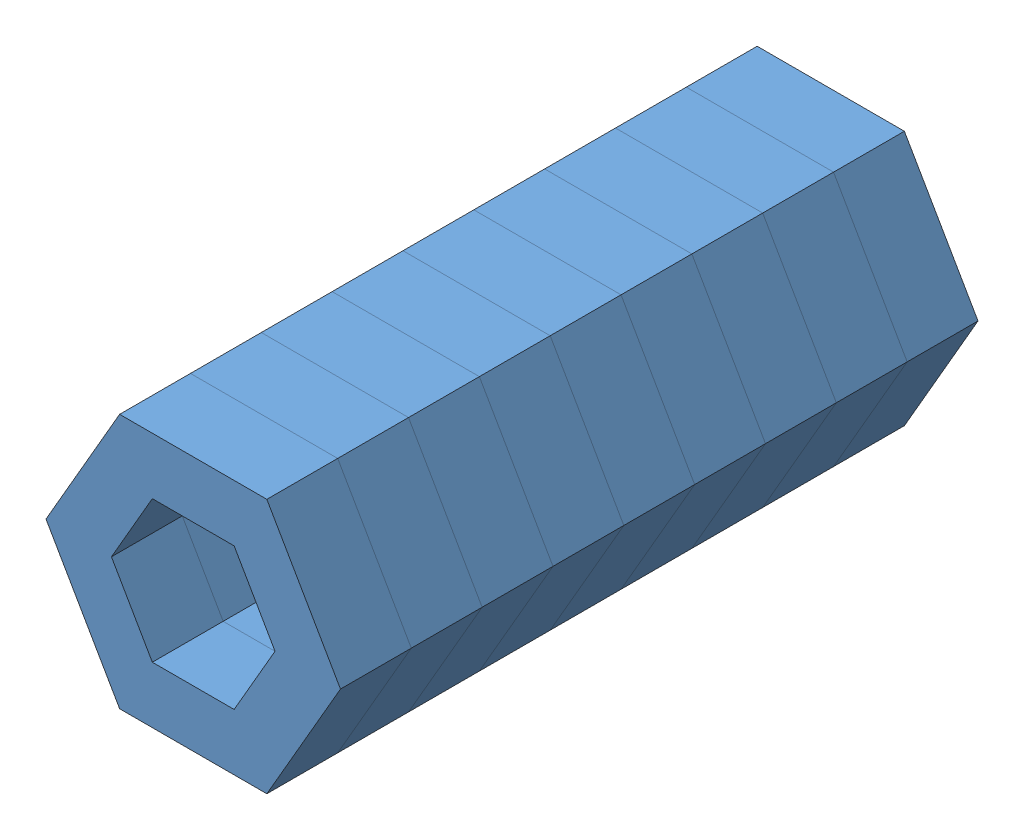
SolidWorks assembly Spacer-stack-9.SLDASM, configuration Default (file format 7000). Lengths in mm.
Overall size (13.2 11.43 28.57).
9 component instances, 1 part files, 16 mates.
Components (placement in the parent):
- Spacer-hex-1s4-1: Spacer-hex-1s4.SLDPRT [Default] at (7.8847 8.4687 7.4956) size (13.2 11.43 3.17)
- Spacer-hex-1s4-2: Spacer-hex-1s4.SLDPRT [Default] at (7.8847 8.4687 10.6706) size (13.2 11.43 3.17)
- Spacer-hex-1s4-3: Spacer-hex-1s4.SLDPRT [Default] at (7.8847 8.4687 13.8456) size (13.2 11.43 3.17)
- Spacer-hex-1s4-4: Spacer-hex-1s4.SLDPRT [Default] at (7.8847 8.4687 17.0206) size (13.2 11.43 3.17)
- Spacer-hex-1s4-5: Spacer-hex-1s4.SLDPRT [Default] at (7.8847 8.4687 20.1956) size (13.2 11.43 3.17)
- Spacer-hex-1s4-6: Spacer-hex-1s4.SLDPRT [Default] at (7.8847 8.4687 23.3706) size (13.2 11.43 3.17)
- Spacer-hex-1s4-7: Spacer-hex-1s4.SLDPRT [Default] at (7.8847 8.4687 26.5456) size (13.2 11.43 3.17)
- Spacer-hex-1s4-8: Spacer-hex-1s4.SLDPRT [Default] at (7.8847 8.4687 29.7206) size (13.2 11.43 3.17)
- Spacer-hex-1s4-9: Spacer-hex-1s4.SLDPRT [Default] at (7.8847 8.4687 32.8956) size (13.2 11.43 3.17)
Mates (geometry in assembly coordinates):
- Coincident3: coincident aligned: line of Spacer-hex-1s4-1 through (9.7178 11.6437 10.6706) axis (-1 0 0); line of Spacer-hex-1s4-2 through (9.7178 11.6437 10.6706) axis (-1 0 0)
- Coincident4: coincident aligned: line of Spacer-hex-1s4-1 through (11.5509 8.4687 10.6706) axis (-0.5 0.866025 0); line of Spacer-hex-1s4-2 through (11.5509 8.4687 10.6706) axis (-0.5 0.866025 0)
- Coincident5: coincident aligned: line of Spacer-hex-1s4-2 through (9.7178 11.6437 13.8456) axis (-1 0 0); line of Spacer-hex-1s4-3 through (9.7178 11.6437 13.8456) axis (-1 0 0)
- Coincident6: coincident aligned: line of Spacer-hex-1s4-2 through (11.5509 8.4687 13.8456) axis (-0.5 0.866025 0); line of Spacer-hex-1s4-3 through (11.5509 8.4687 13.8456) axis (-0.5 0.866025 0)
- Coincident9: coincident aligned: line of Spacer-hex-1s4-3 through (11.5509 8.4687 17.0206) axis (-0.5 0.866025 0); line of Spacer-hex-1s4-4 through (11.5509 8.4687 17.0206) axis (-0.5 0.866025 0)
- Coincident10: coincident aligned: line of Spacer-hex-1s4-3 through (9.7178 11.6437 17.0206) axis (-1 0 0); line of Spacer-hex-1s4-4 through (9.7178 11.6437 17.0206) axis (-1 0 0)
- Coincident11: coincident aligned: line of Spacer-hex-1s4-4 through (9.7178 11.6437 20.1956) axis (-1 0 0); line of Spacer-hex-1s4-5 through (9.7178 11.6437 20.1956) axis (-1 0 0)
- Coincident12: coincident aligned: line of Spacer-hex-1s4-4 through (11.5509 8.4687 20.1956) axis (-0.5 0.866025 0); line of Spacer-hex-1s4-5 through (11.5509 8.4687 20.1956) axis (-0.5 0.866025 0)
- Coincident13: coincident aligned: line of Spacer-hex-1s4-5 through (9.7178 11.6437 23.3706) axis (-1 0 0); line of Spacer-hex-1s4-6 through (9.7178 11.6437 23.3706) axis (-1 0 0)
- Coincident14: coincident aligned: line of Spacer-hex-1s4-5 through (11.5509 8.4687 23.3706) axis (-0.5 0.866025 0); line of Spacer-hex-1s4-6 through (11.5509 8.4687 23.3706) axis (-0.5 0.866025 0)
- Coincident15: coincident aligned: line of Spacer-hex-1s4-6 through (9.7178 11.6437 26.5456) axis (-1 0 0); line of Spacer-hex-1s4-7 through (9.7178 11.6437 26.5456) axis (-1 0 0)
- Coincident16: coincident aligned: line of Spacer-hex-1s4-6 through (11.5509 8.4687 26.5456) axis (-0.5 0.866025 0); line of Spacer-hex-1s4-7 through (11.5509 8.4687 26.5456) axis (-0.5 0.866025 0)
- Coincident17: coincident aligned: line of Spacer-hex-1s4-7 through (9.7178 11.6437 29.7206) axis (-1 0 0); line of Spacer-hex-1s4-8 through (9.7178 11.6437 29.7206) axis (-1 0 0)
- Coincident18: coincident aligned: line of Spacer-hex-1s4-7 through (11.5509 8.4687 29.7206) axis (-0.5 0.866025 0); line of Spacer-hex-1s4-8 through (11.5509 8.4687 29.7206) axis (-0.5 0.866025 0)
- Coincident19: coincident aligned: line of Spacer-hex-1s4-8 through (9.7178 11.6437 32.8956) axis (-1 0 0); line of Spacer-hex-1s4-9 through (9.7178 11.6437 32.8956) axis (-1 0 0)
- Coincident20: coincident aligned: line of Spacer-hex-1s4-8 through (11.5509 8.4687 32.8956) axis (-0.5 0.866025 0); line of Spacer-hex-1s4-9 through (11.5509 8.4687 32.8956) axis (-0.5 0.866025 0)
